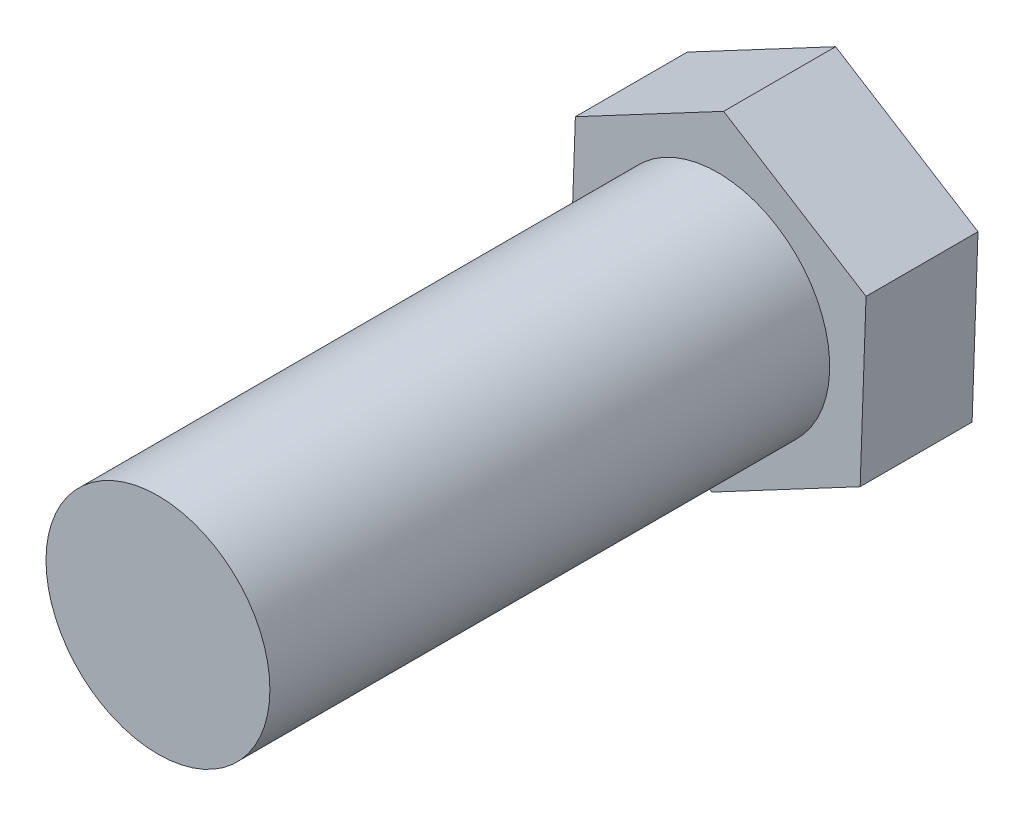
from build123d import *

# Parameters (mm, degrees)
CROQUIS1_R              = 5
SALIENTE_EXTRUIR1_DEPTH = 30
SALIENTE_EXTRUIR2_DEPTH = 5


with BuildPart() as part:
    # Croquis1 → Saliente-Extruir1 (new body)
    with BuildSketch(Plane.XY):
        Circle(CROQUIS1_R)
    extrude(amount=SALIENTE_EXTRUIR1_DEPTH)

    # Croquis2 → Saliente-Extruir2 (add)
    with BuildSketch(Plane(origin=(0, 0, 0), x_dir=(-1, 0, 0), z_dir=(0, 0, -1))):
        Polygon((-0.263497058, 7.495369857), (-6.622929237, 3.519489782), (-6.359432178, -3.975880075), (0.263497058, -7.495369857), (6.622929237, -3.519489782), (6.359432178, 3.975880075), align=None)
    extrude(amount=-SALIENTE_EXTRUIR2_DEPTH)


solid = part.part
